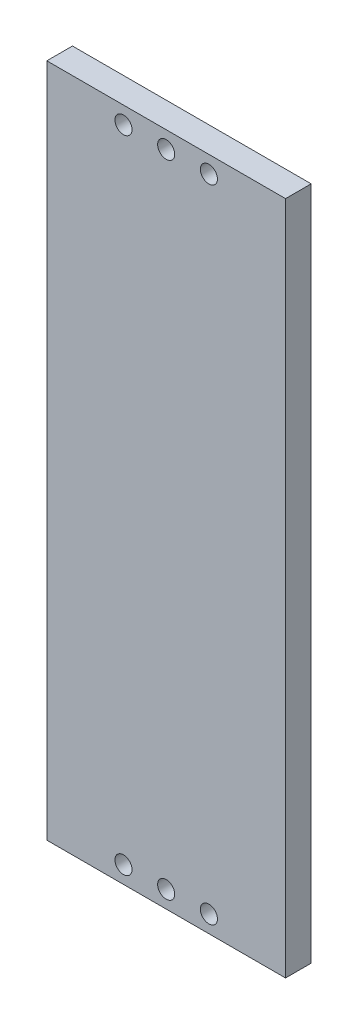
ISO-10303-21;
HEADER;
FILE_DESCRIPTION(('STEP AP214'),'2;1');
FILE_NAME('part.step','',(''),(''),'','','');
FILE_SCHEMA(('AUTOMOTIVE_DESIGN { 1 0 10303 214 1 1 1 1 }'));
ENDSEC;
DATA;
#1=APPLICATION_CONTEXT('core data for automotive mechanical design processes');
#2=APPLICATION_PROTOCOL_DEFINITION('international standard','automotive_design',2000,#1);
#3=PRODUCT_CONTEXT('',#1,'mechanical');
#4=PRODUCT('Part','Part','',(#3));
#5=PRODUCT_RELATED_PRODUCT_CATEGORY('part','',(#4));
#6=PRODUCT_DEFINITION_FORMATION('','',#4);
#7=PRODUCT_DEFINITION_CONTEXT('part definition',#1,'design');
#8=PRODUCT_DEFINITION('design','',#6,#7);
#9=PRODUCT_DEFINITION_SHAPE('','',#8);
#10=(LENGTH_UNIT() NAMED_UNIT(*) SI_UNIT(.MILLI.,.METRE.));
#11=(NAMED_UNIT(*) PLANE_ANGLE_UNIT() SI_UNIT($,.RADIAN.));
#12=(NAMED_UNIT(*) SI_UNIT($,.STERADIAN.) SOLID_ANGLE_UNIT());
#13=UNCERTAINTY_MEASURE_WITH_UNIT(LENGTH_MEASURE(1.E-05),#10,'distance_accuracy_value','');
#14=(GEOMETRIC_REPRESENTATION_CONTEXT(3) GLOBAL_UNCERTAINTY_ASSIGNED_CONTEXT((#13)) GLOBAL_UNIT_ASSIGNED_CONTEXT((#10,
#11,#12)) REPRESENTATION_CONTEXT('',''));
#15=CARTESIAN_POINT('',(0.,0.,0.));
#16=DIRECTION('',(0.,0.,1.));
#17=DIRECTION('',(1.,0.,0.));
#18=AXIS2_PLACEMENT_3D('',#15,#16,#17);
#19=CARTESIAN_POINT('',(0.,0.,3.));
#20=DIRECTION('',(0.,0.,1.));
#21=DIRECTION('',(1.,0.,0.));
#22=AXIS2_PLACEMENT_3D('',#19,#20,#21);
#23=PLANE('',#22);
#24=CARTESIAN_POINT('',(0.,9.00000000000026,3.));
#25=DIRECTION('',(0.,0.,1.));
#26=DIRECTION('',(-1.,0.,0.));
#27=AXIS2_PLACEMENT_3D('',#24,#25,#26);
#28=CIRCLE('',#27,1.);
#29=CARTESIAN_POINT('',(-1.00000000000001,9.00000000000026,3.));
#30=VERTEX_POINT('',#29);
#31=EDGE_CURVE('E143',#30,#30,#28,.T.);
#32=ORIENTED_EDGE('',*,*,#31,.F.);
#33=EDGE_LOOP('',(#32));
#34=FACE_BOUND('',#33,.T.);
#35=CARTESIAN_POINT('',(-5.00000000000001,-65.9999999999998,3.));
#36=DIRECTION('',(0.,0.,1.));
#37=DIRECTION('',(1.,0.,0.));
#38=AXIS2_PLACEMENT_3D('',#35,#36,#37);
#39=CIRCLE('',#38,1.);
#40=CARTESIAN_POINT('',(-4.00000000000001,-65.9999999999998,3.));
#41=VERTEX_POINT('',#40);
#42=EDGE_CURVE('E131',#41,#41,#39,.T.);
#43=ORIENTED_EDGE('',*,*,#42,.F.);
#44=EDGE_LOOP('',(#43));
#45=FACE_BOUND('',#44,.T.);
#46=CARTESIAN_POINT('',(0.,-65.9999999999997,3.));
#47=DIRECTION('',(0.,0.,1.));
#48=DIRECTION('',(1.,0.,0.));
#49=AXIS2_PLACEMENT_3D('',#46,#47,#48);
#50=CIRCLE('',#49,1.);
#51=CARTESIAN_POINT('',(0.999999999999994,-65.9999999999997,3.));
#52=VERTEX_POINT('',#51);
#53=EDGE_CURVE('E110',#52,#52,#50,.T.);
#54=ORIENTED_EDGE('',*,*,#53,.F.);
#55=EDGE_LOOP('',(#54));
#56=FACE_BOUND('',#55,.T.);
#57=DIRECTION('',(0.,-1.,0.));
#58=VECTOR('',#57,1.);
#59=CARTESIAN_POINT('',(-13.97,11.0000000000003,3.));
#60=LINE('',#59,#58);
#61=CARTESIAN_POINT('',(-13.97,11.0000000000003,3.));
#62=VERTEX_POINT('',#61);
#63=CARTESIAN_POINT('',(-13.97,-67.9999999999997,3.));
#64=VERTEX_POINT('',#63);
#65=EDGE_CURVE('E95',#62,#64,#60,.T.);
#66=ORIENTED_EDGE('',*,*,#65,.T.);
#67=DIRECTION('',(1.,0.,0.));
#68=VECTOR('',#67,1.);
#69=CARTESIAN_POINT('',(-13.97,-67.9999999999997,3.));
#70=LINE('',#69,#68);
#71=CARTESIAN_POINT('',(13.97,-67.9999999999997,3.));
#72=VERTEX_POINT('',#71);
#73=EDGE_CURVE('E90',#64,#72,#70,.T.);
#74=ORIENTED_EDGE('',*,*,#73,.T.);
#75=DIRECTION('',(0.,1.,0.));
#76=VECTOR('',#75,1.);
#77=CARTESIAN_POINT('',(13.97,11.0000000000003,3.));
#78=LINE('',#77,#76);
#79=CARTESIAN_POINT('',(13.97,11.0000000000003,3.));
#80=VERTEX_POINT('',#79);
#81=EDGE_CURVE('E93',#72,#80,#78,.T.);
#82=ORIENTED_EDGE('',*,*,#81,.T.);
#83=DIRECTION('',(-1.,0.,0.));
#84=VECTOR('',#83,1.);
#85=CARTESIAN_POINT('',(-13.97,11.0000000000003,3.));
#86=LINE('',#85,#84);
#87=EDGE_CURVE('E60',#80,#62,#86,.T.);
#88=ORIENTED_EDGE('',*,*,#87,.T.);
#89=EDGE_LOOP('',(#66,#74,#82,#88));
#90=FACE_BOUND('',#89,.T.);
#91=CARTESIAN_POINT('',(4.99999999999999,-65.9999999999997,3.));
#92=DIRECTION('',(0.,0.,1.));
#93=DIRECTION('',(1.,0.,0.));
#94=AXIS2_PLACEMENT_3D('',#91,#92,#93);
#95=CIRCLE('',#94,1.);
#96=CARTESIAN_POINT('',(5.99999999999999,-65.9999999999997,3.));
#97=VERTEX_POINT('',#96);
#98=EDGE_CURVE('E125',#97,#97,#95,.T.);
#99=ORIENTED_EDGE('',*,*,#98,.F.);
#100=EDGE_LOOP('',(#99));
#101=FACE_BOUND('',#100,.T.);
#102=CARTESIAN_POINT('',(4.99999999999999,9.00000000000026,3.));
#103=DIRECTION('',(0.,0.,1.));
#104=DIRECTION('',(-1.,0.,0.));
#105=AXIS2_PLACEMENT_3D('',#102,#103,#104);
#106=CIRCLE('',#105,1.);
#107=CARTESIAN_POINT('',(3.99999999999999,9.00000000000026,3.));
#108=VERTEX_POINT('',#107);
#109=EDGE_CURVE('E137',#108,#108,#106,.T.);
#110=ORIENTED_EDGE('',*,*,#109,.F.);
#111=EDGE_LOOP('',(#110));
#112=FACE_BOUND('',#111,.T.);
#113=CARTESIAN_POINT('',(-5.00000000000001,9.0000000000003,3.));
#114=DIRECTION('',(0.,0.,1.));
#115=DIRECTION('',(-1.,0.,0.));
#116=AXIS2_PLACEMENT_3D('',#113,#114,#115);
#117=CIRCLE('',#116,1.);
#118=CARTESIAN_POINT('',(-6.00000000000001,9.0000000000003,3.));
#119=VERTEX_POINT('',#118);
#120=EDGE_CURVE('E149',#119,#119,#117,.T.);
#121=ORIENTED_EDGE('',*,*,#120,.F.);
#122=EDGE_LOOP('',(#121));
#123=FACE_BOUND('',#122,.T.);
#124=ADVANCED_FACE('F43',(#34,#45,#56,#90,#101,#112,#123),#23,.T.);
#125=CARTESIAN_POINT('',(0.,0.,0.));
#126=DIRECTION('',(0.,0.,1.));
#127=DIRECTION('',(1.,0.,0.));
#128=AXIS2_PLACEMENT_3D('',#125,#126,#127);
#129=PLANE('',#128);
#130=DIRECTION('',(0.,-1.,0.));
#131=VECTOR('',#130,1.);
#132=CARTESIAN_POINT('',(-13.97,11.0000000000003,0.));
#133=LINE('',#132,#131);
#134=CARTESIAN_POINT('',(-13.97,11.0000000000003,0.));
#135=VERTEX_POINT('',#134);
#136=CARTESIAN_POINT('',(-13.97,-67.9999999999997,0.));
#137=VERTEX_POINT('',#136);
#138=EDGE_CURVE('E107',#135,#137,#133,.T.);
#139=ORIENTED_EDGE('',*,*,#138,.F.);
#140=DIRECTION('',(-1.,0.,0.));
#141=VECTOR('',#140,1.);
#142=CARTESIAN_POINT('',(-13.97,11.0000000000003,0.));
#143=LINE('',#142,#141);
#144=CARTESIAN_POINT('',(13.97,11.0000000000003,0.));
#145=VERTEX_POINT('',#144);
#146=EDGE_CURVE('E83',#145,#135,#143,.T.);
#147=ORIENTED_EDGE('',*,*,#146,.F.);
#148=DIRECTION('',(0.,1.,0.));
#149=VECTOR('',#148,1.);
#150=CARTESIAN_POINT('',(13.97,11.0000000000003,0.));
#151=LINE('',#150,#149);
#152=CARTESIAN_POINT('',(13.97,-67.9999999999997,0.));
#153=VERTEX_POINT('',#152);
#154=EDGE_CURVE('E77',#153,#145,#151,.T.);
#155=ORIENTED_EDGE('',*,*,#154,.F.);
#156=DIRECTION('',(1.,0.,0.));
#157=VECTOR('',#156,1.);
#158=CARTESIAN_POINT('',(-13.97,-67.9999999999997,0.));
#159=LINE('',#158,#157);
#160=EDGE_CURVE('E99',#137,#153,#159,.T.);
#161=ORIENTED_EDGE('',*,*,#160,.F.);
#162=EDGE_LOOP('',(#139,#147,#155,#161));
#163=FACE_BOUND('',#162,.T.);
#164=CARTESIAN_POINT('',(0.,-65.9999999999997,0.));
#165=DIRECTION('',(0.,0.,1.));
#166=DIRECTION('',(1.,0.,0.));
#167=AXIS2_PLACEMENT_3D('',#164,#165,#166);
#168=CIRCLE('',#167,1.);
#169=CARTESIAN_POINT('',(0.999999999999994,-65.9999999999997,0.));
#170=VERTEX_POINT('',#169);
#171=EDGE_CURVE('E122',#170,#170,#168,.T.);
#172=ORIENTED_EDGE('',*,*,#171,.T.);
#173=EDGE_LOOP('',(#172));
#174=FACE_BOUND('',#173,.T.);
#175=CARTESIAN_POINT('',(4.99999999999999,-65.9999999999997,0.));
#176=DIRECTION('',(0.,0.,1.));
#177=DIRECTION('',(1.,0.,0.));
#178=AXIS2_PLACEMENT_3D('',#175,#176,#177);
#179=CIRCLE('',#178,1.);
#180=CARTESIAN_POINT('',(5.99999999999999,-65.9999999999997,0.));
#181=VERTEX_POINT('',#180);
#182=EDGE_CURVE('E128',#181,#181,#179,.T.);
#183=ORIENTED_EDGE('',*,*,#182,.T.);
#184=EDGE_LOOP('',(#183));
#185=FACE_BOUND('',#184,.T.);
#186=CARTESIAN_POINT('',(-5.00000000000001,-65.9999999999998,0.));
#187=DIRECTION('',(0.,0.,1.));
#188=DIRECTION('',(1.,0.,0.));
#189=AXIS2_PLACEMENT_3D('',#186,#187,#188);
#190=CIRCLE('',#189,1.);
#191=CARTESIAN_POINT('',(-4.00000000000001,-65.9999999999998,0.));
#192=VERTEX_POINT('',#191);
#193=EDGE_CURVE('E134',#192,#192,#190,.T.);
#194=ORIENTED_EDGE('',*,*,#193,.T.);
#195=EDGE_LOOP('',(#194));
#196=FACE_BOUND('',#195,.T.);
#197=CARTESIAN_POINT('',(4.99999999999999,9.00000000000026,0.));
#198=DIRECTION('',(0.,0.,1.));
#199=DIRECTION('',(-1.,0.,0.));
#200=AXIS2_PLACEMENT_3D('',#197,#198,#199);
#201=CIRCLE('',#200,1.);
#202=CARTESIAN_POINT('',(3.99999999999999,9.00000000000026,0.));
#203=VERTEX_POINT('',#202);
#204=EDGE_CURVE('E140',#203,#203,#201,.T.);
#205=ORIENTED_EDGE('',*,*,#204,.T.);
#206=EDGE_LOOP('',(#205));
#207=FACE_BOUND('',#206,.T.);
#208=CARTESIAN_POINT('',(0.,9.00000000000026,0.));
#209=DIRECTION('',(0.,0.,1.));
#210=DIRECTION('',(-1.,0.,0.));
#211=AXIS2_PLACEMENT_3D('',#208,#209,#210);
#212=CIRCLE('',#211,1.);
#213=CARTESIAN_POINT('',(-1.00000000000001,9.00000000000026,0.));
#214=VERTEX_POINT('',#213);
#215=EDGE_CURVE('E146',#214,#214,#212,.T.);
#216=ORIENTED_EDGE('',*,*,#215,.T.);
#217=EDGE_LOOP('',(#216));
#218=FACE_BOUND('',#217,.T.);
#219=CARTESIAN_POINT('',(-5.00000000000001,9.0000000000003,0.));
#220=DIRECTION('',(0.,0.,1.));
#221=DIRECTION('',(-1.,0.,0.));
#222=AXIS2_PLACEMENT_3D('',#219,#220,#221);
#223=CIRCLE('',#222,1.);
#224=CARTESIAN_POINT('',(-6.00000000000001,9.0000000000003,0.));
#225=VERTEX_POINT('',#224);
#226=EDGE_CURVE('E152',#225,#225,#223,.T.);
#227=ORIENTED_EDGE('',*,*,#226,.T.);
#228=EDGE_LOOP('',(#227));
#229=FACE_BOUND('',#228,.T.);
#230=ADVANCED_FACE('F118',(#163,#174,#185,#196,#207,#218,#229),#129,.F.);
#231=CARTESIAN_POINT('',(-13.97,11.0000000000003,3.));
#232=DIRECTION('',(1.,0.,0.));
#233=DIRECTION('',(0.,1.,0.));
#234=AXIS2_PLACEMENT_3D('',#231,#232,#233);
#235=PLANE('',#234);
#236=ORIENTED_EDGE('',*,*,#138,.T.);
#237=DIRECTION('',(0.,0.,-1.));
#238=VECTOR('',#237,1.);
#239=CARTESIAN_POINT('',(-13.97,-67.9999999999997,3.));
#240=LINE('',#239,#238);
#241=EDGE_CURVE('E11',#64,#137,#240,.T.);
#242=ORIENTED_EDGE('',*,*,#241,.F.);
#243=ORIENTED_EDGE('',*,*,#65,.F.);
#244=DIRECTION('',(0.,0.,-1.));
#245=VECTOR('',#244,1.);
#246=CARTESIAN_POINT('',(-13.97,11.0000000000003,3.));
#247=LINE('',#246,#245);
#248=EDGE_CURVE('E103',#62,#135,#247,.T.);
#249=ORIENTED_EDGE('',*,*,#248,.T.);
#250=EDGE_LOOP('',(#236,#242,#243,#249));
#251=FACE_BOUND('',#250,.T.);
#252=ADVANCED_FACE('F45',(#251),#235,.F.);
#253=CARTESIAN_POINT('',(-13.97,-67.9999999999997,3.));
#254=DIRECTION('',(0.,1.,0.));
#255=DIRECTION('',(0.,0.,1.));
#256=AXIS2_PLACEMENT_3D('',#253,#254,#255);
#257=PLANE('',#256);
#258=ORIENTED_EDGE('',*,*,#160,.T.);
#259=DIRECTION('',(0.,0.,-1.));
#260=VECTOR('',#259,1.);
#261=CARTESIAN_POINT('',(13.97,-67.9999999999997,3.));
#262=LINE('',#261,#260);
#263=EDGE_CURVE('E52',#72,#153,#262,.T.);
#264=ORIENTED_EDGE('',*,*,#263,.F.);
#265=ORIENTED_EDGE('',*,*,#73,.F.);
#266=ORIENTED_EDGE('',*,*,#241,.T.);
#267=EDGE_LOOP('',(#258,#264,#265,#266));
#268=FACE_BOUND('',#267,.T.);
#269=ADVANCED_FACE('F98',(#268),#257,.F.);
#270=CARTESIAN_POINT('',(13.97,11.0000000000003,3.));
#271=DIRECTION('',(-1.,0.,0.));
#272=DIRECTION('',(0.,-1.,0.));
#273=AXIS2_PLACEMENT_3D('',#270,#271,#272);
#274=PLANE('',#273);
#275=ORIENTED_EDGE('',*,*,#154,.T.);
#276=DIRECTION('',(0.,0.,-1.));
#277=VECTOR('',#276,1.);
#278=CARTESIAN_POINT('',(13.97,11.0000000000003,3.));
#279=LINE('',#278,#277);
#280=EDGE_CURVE('E100',#80,#145,#279,.T.);
#281=ORIENTED_EDGE('',*,*,#280,.F.);
#282=ORIENTED_EDGE('',*,*,#81,.F.);
#283=ORIENTED_EDGE('',*,*,#263,.T.);
#284=EDGE_LOOP('',(#275,#281,#282,#283));
#285=FACE_BOUND('',#284,.T.);
#286=ADVANCED_FACE('F101',(#285),#274,.F.);
#287=CARTESIAN_POINT('',(-13.97,11.0000000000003,3.));
#288=DIRECTION('',(0.,-1.,0.));
#289=DIRECTION('',(0.,0.,-1.));
#290=AXIS2_PLACEMENT_3D('',#287,#288,#289);
#291=PLANE('',#290);
#292=ORIENTED_EDGE('',*,*,#146,.T.);
#293=ORIENTED_EDGE('',*,*,#248,.F.);
#294=ORIENTED_EDGE('',*,*,#87,.F.);
#295=ORIENTED_EDGE('',*,*,#280,.T.);
#296=EDGE_LOOP('',(#292,#293,#294,#295));
#297=FACE_BOUND('',#296,.T.);
#298=ADVANCED_FACE('F115',(#297),#291,.F.);
#299=CARTESIAN_POINT('',(0.,-65.9999999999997,3.));
#300=DIRECTION('',(0.,0.,-1.));
#301=DIRECTION('',(-1.,0.,0.));
#302=AXIS2_PLACEMENT_3D('',#299,#300,#301);
#303=CYLINDRICAL_SURFACE('',#302,1.);
#304=ORIENTED_EDGE('',*,*,#53,.T.);
#305=EDGE_LOOP('',(#304));
#306=FACE_BOUND('',#305,.T.);
#307=ORIENTED_EDGE('',*,*,#171,.F.);
#308=EDGE_LOOP('',(#307));
#309=FACE_BOUND('',#308,.T.);
#310=ADVANCED_FACE('F171',(#306,#309),#303,.F.);
#311=CARTESIAN_POINT('',(4.99999999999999,-65.9999999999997,3.));
#312=DIRECTION('',(0.,0.,-1.));
#313=DIRECTION('',(-1.,0.,0.));
#314=AXIS2_PLACEMENT_3D('',#311,#312,#313);
#315=CYLINDRICAL_SURFACE('',#314,1.);
#316=ORIENTED_EDGE('',*,*,#98,.T.);
#317=EDGE_LOOP('',(#316));
#318=FACE_BOUND('',#317,.T.);
#319=ORIENTED_EDGE('',*,*,#182,.F.);
#320=EDGE_LOOP('',(#319));
#321=FACE_BOUND('',#320,.T.);
#322=ADVANCED_FACE('F216',(#318,#321),#315,.F.);
#323=CARTESIAN_POINT('',(-5.00000000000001,-65.9999999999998,3.));
#324=DIRECTION('',(0.,0.,-1.));
#325=DIRECTION('',(-1.,0.,0.));
#326=AXIS2_PLACEMENT_3D('',#323,#324,#325);
#327=CYLINDRICAL_SURFACE('',#326,1.);
#328=ORIENTED_EDGE('',*,*,#42,.T.);
#329=EDGE_LOOP('',(#328));
#330=FACE_BOUND('',#329,.T.);
#331=ORIENTED_EDGE('',*,*,#193,.F.);
#332=EDGE_LOOP('',(#331));
#333=FACE_BOUND('',#332,.T.);
#334=ADVANCED_FACE('F224',(#330,#333),#327,.F.);
#335=CARTESIAN_POINT('',(4.99999999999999,9.00000000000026,3.));
#336=DIRECTION('',(0.,0.,-1.));
#337=DIRECTION('',(-1.,0.,0.));
#338=AXIS2_PLACEMENT_3D('',#335,#336,#337);
#339=CYLINDRICAL_SURFACE('',#338,1.);
#340=ORIENTED_EDGE('',*,*,#109,.T.);
#341=EDGE_LOOP('',(#340));
#342=FACE_BOUND('',#341,.T.);
#343=ORIENTED_EDGE('',*,*,#204,.F.);
#344=EDGE_LOOP('',(#343));
#345=FACE_BOUND('',#344,.T.);
#346=ADVANCED_FACE('F232',(#342,#345),#339,.F.);
#347=CARTESIAN_POINT('',(0.,9.00000000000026,3.));
#348=DIRECTION('',(0.,0.,-1.));
#349=DIRECTION('',(-1.,0.,0.));
#350=AXIS2_PLACEMENT_3D('',#347,#348,#349);
#351=CYLINDRICAL_SURFACE('',#350,1.);
#352=ORIENTED_EDGE('',*,*,#31,.T.);
#353=EDGE_LOOP('',(#352));
#354=FACE_BOUND('',#353,.T.);
#355=ORIENTED_EDGE('',*,*,#215,.F.);
#356=EDGE_LOOP('',(#355));
#357=FACE_BOUND('',#356,.T.);
#358=ADVANCED_FACE('F241',(#354,#357),#351,.F.);
#359=CARTESIAN_POINT('',(-5.00000000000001,9.0000000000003,3.));
#360=DIRECTION('',(0.,0.,-1.));
#361=DIRECTION('',(-1.,0.,0.));
#362=AXIS2_PLACEMENT_3D('',#359,#360,#361);
#363=CYLINDRICAL_SURFACE('',#362,1.);
#364=ORIENTED_EDGE('',*,*,#120,.T.);
#365=EDGE_LOOP('',(#364));
#366=FACE_BOUND('',#365,.T.);
#367=ORIENTED_EDGE('',*,*,#226,.F.);
#368=EDGE_LOOP('',(#367));
#369=FACE_BOUND('',#368,.T.);
#370=ADVANCED_FACE('F158',(#366,#369),#363,.F.);
#371=CLOSED_SHELL('',(#124,#230,#252,#269,#286,#298,#310,#322,#334,#346,#358,#370));
#372=MANIFOLD_SOLID_BREP('B2',#371);
#373=ADVANCED_BREP_SHAPE_REPRESENTATION('',(#18,#372),#14);
#374=SHAPE_DEFINITION_REPRESENTATION(#9,#373);
ENDSEC;
END-ISO-10303-21;
